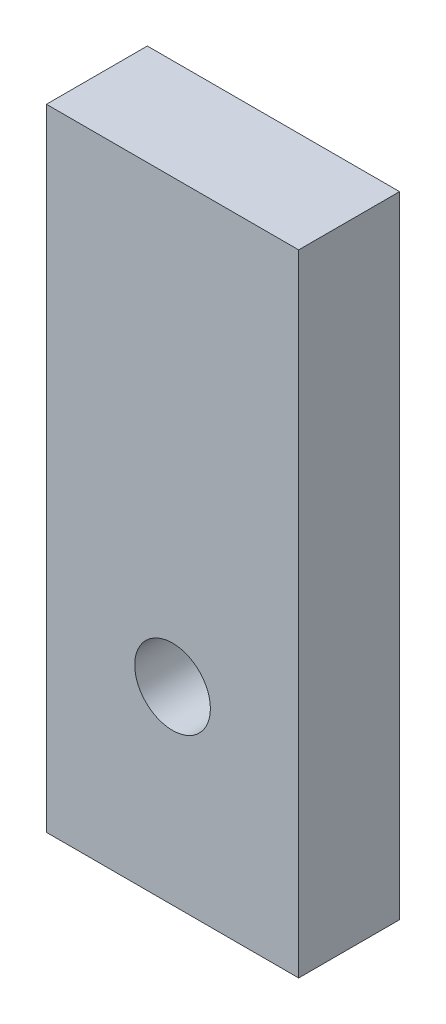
ISO-10303-21;
HEADER;
FILE_DESCRIPTION(('STEP AP214'),'2;1');
FILE_NAME('part.step','',(''),(''),'','','');
FILE_SCHEMA(('AUTOMOTIVE_DESIGN { 1 0 10303 214 1 1 1 1 }'));
ENDSEC;
DATA;
#1=APPLICATION_CONTEXT('core data for automotive mechanical design processes');
#2=APPLICATION_PROTOCOL_DEFINITION('international standard','automotive_design',2000,#1);
#3=PRODUCT_CONTEXT('',#1,'mechanical');
#4=PRODUCT('Part','Part','',(#3));
#5=PRODUCT_RELATED_PRODUCT_CATEGORY('part','',(#4));
#6=PRODUCT_DEFINITION_FORMATION('','',#4);
#7=PRODUCT_DEFINITION_CONTEXT('part definition',#1,'design');
#8=PRODUCT_DEFINITION('design','',#6,#7);
#9=PRODUCT_DEFINITION_SHAPE('','',#8);
#10=(LENGTH_UNIT() NAMED_UNIT(*) SI_UNIT(.MILLI.,.METRE.));
#11=(NAMED_UNIT(*) PLANE_ANGLE_UNIT() SI_UNIT($,.RADIAN.));
#12=(NAMED_UNIT(*) SI_UNIT($,.STERADIAN.) SOLID_ANGLE_UNIT());
#13=UNCERTAINTY_MEASURE_WITH_UNIT(LENGTH_MEASURE(1.E-05),#10,'distance_accuracy_value','');
#14=(GEOMETRIC_REPRESENTATION_CONTEXT(3) GLOBAL_UNCERTAINTY_ASSIGNED_CONTEXT((#13)) GLOBAL_UNIT_ASSIGNED_CONTEXT((#10,
#11,#12)) REPRESENTATION_CONTEXT('',''));
#15=CARTESIAN_POINT('',(0.,0.,0.));
#16=DIRECTION('',(0.,0.,1.));
#17=DIRECTION('',(1.,0.,0.));
#18=AXIS2_PLACEMENT_3D('',#15,#16,#17);
#19=CARTESIAN_POINT('',(0.,0.,4.));
#20=DIRECTION('',(0.,0.,-1.));
#21=DIRECTION('',(-1.,0.,0.));
#22=AXIS2_PLACEMENT_3D('',#19,#20,#21);
#23=PLANE('',#22);
#24=DIRECTION('',(0.,-1.,0.));
#25=VECTOR('',#24,1.);
#26=CARTESIAN_POINT('',(0.,0.,4.));
#27=LINE('',#26,#25);
#28=CARTESIAN_POINT('',(0.,25.,4.));
#29=VERTEX_POINT('',#28);
#30=CARTESIAN_POINT('',(0.,0.,4.));
#31=VERTEX_POINT('',#30);
#32=EDGE_CURVE('E87',#29,#31,#27,.T.);
#33=ORIENTED_EDGE('',*,*,#32,.T.);
#34=DIRECTION('',(1.,0.,0.));
#35=VECTOR('',#34,1.);
#36=CARTESIAN_POINT('',(0.,0.,4.));
#37=LINE('',#36,#35);
#38=CARTESIAN_POINT('',(10.,0.,4.));
#39=VERTEX_POINT('',#38);
#40=EDGE_CURVE('E82',#31,#39,#37,.T.);
#41=ORIENTED_EDGE('',*,*,#40,.T.);
#42=DIRECTION('',(0.,1.,0.));
#43=VECTOR('',#42,1.);
#44=CARTESIAN_POINT('',(10.,0.,4.));
#45=LINE('',#44,#43);
#46=CARTESIAN_POINT('',(10.,25.,4.));
#47=VERTEX_POINT('',#46);
#48=EDGE_CURVE('E85',#39,#47,#45,.T.);
#49=ORIENTED_EDGE('',*,*,#48,.T.);
#50=DIRECTION('',(-1.,0.,0.));
#51=VECTOR('',#50,1.);
#52=CARTESIAN_POINT('',(0.,25.,4.));
#53=LINE('',#52,#51);
#54=EDGE_CURVE('E52',#47,#29,#53,.T.);
#55=ORIENTED_EDGE('',*,*,#54,.T.);
#56=EDGE_LOOP('',(#33,#41,#49,#55));
#57=FACE_BOUND('',#56,.T.);
#58=CARTESIAN_POINT('',(5.,7.5,4.));
#59=DIRECTION('',(0.,0.,1.));
#60=DIRECTION('',(1.,0.,0.));
#61=AXIS2_PLACEMENT_3D('',#58,#59,#60);
#62=CIRCLE('',#61,1.5);
#63=CARTESIAN_POINT('',(6.5,7.5,4.));
#64=VERTEX_POINT('',#63);
#65=EDGE_CURVE('E102',#64,#64,#62,.T.);
#66=ORIENTED_EDGE('',*,*,#65,.F.);
#67=EDGE_LOOP('',(#66));
#68=FACE_BOUND('',#67,.T.);
#69=ADVANCED_FACE('F35',(#57,#68),#23,.F.);
#70=CARTESIAN_POINT('',(0.,0.,0.));
#71=DIRECTION('',(0.,0.,-1.));
#72=DIRECTION('',(-1.,0.,0.));
#73=AXIS2_PLACEMENT_3D('',#70,#71,#72);
#74=PLANE('',#73);
#75=DIRECTION('',(0.,-1.,0.));
#76=VECTOR('',#75,1.);
#77=CARTESIAN_POINT('',(0.,0.,0.));
#78=LINE('',#77,#76);
#79=CARTESIAN_POINT('',(0.,25.,0.));
#80=VERTEX_POINT('',#79);
#81=CARTESIAN_POINT('',(0.,0.,0.));
#82=VERTEX_POINT('',#81);
#83=EDGE_CURVE('E99',#80,#82,#78,.T.);
#84=ORIENTED_EDGE('',*,*,#83,.F.);
#85=DIRECTION('',(-1.,0.,0.));
#86=VECTOR('',#85,1.);
#87=CARTESIAN_POINT('',(0.,25.,0.));
#88=LINE('',#87,#86);
#89=CARTESIAN_POINT('',(10.,25.,0.));
#90=VERTEX_POINT('',#89);
#91=EDGE_CURVE('E75',#90,#80,#88,.T.);
#92=ORIENTED_EDGE('',*,*,#91,.F.);
#93=DIRECTION('',(0.,1.,0.));
#94=VECTOR('',#93,1.);
#95=CARTESIAN_POINT('',(10.,0.,0.));
#96=LINE('',#95,#94);
#97=CARTESIAN_POINT('',(10.,0.,0.));
#98=VERTEX_POINT('',#97);
#99=EDGE_CURVE('E69',#98,#90,#96,.T.);
#100=ORIENTED_EDGE('',*,*,#99,.F.);
#101=DIRECTION('',(1.,0.,0.));
#102=VECTOR('',#101,1.);
#103=CARTESIAN_POINT('',(0.,0.,0.));
#104=LINE('',#103,#102);
#105=EDGE_CURVE('E91',#82,#98,#104,.T.);
#106=ORIENTED_EDGE('',*,*,#105,.F.);
#107=EDGE_LOOP('',(#84,#92,#100,#106));
#108=FACE_BOUND('',#107,.T.);
#109=CARTESIAN_POINT('',(5.,7.5,0.));
#110=DIRECTION('',(0.,0.,1.));
#111=DIRECTION('',(1.,0.,0.));
#112=AXIS2_PLACEMENT_3D('',#109,#110,#111);
#113=CIRCLE('',#112,1.5);
#114=CARTESIAN_POINT('',(6.5,7.5,0.));
#115=VERTEX_POINT('',#114);
#116=EDGE_CURVE('E114',#115,#115,#113,.T.);
#117=ORIENTED_EDGE('',*,*,#116,.T.);
#118=EDGE_LOOP('',(#117));
#119=FACE_BOUND('',#118,.T.);
#120=ADVANCED_FACE('F110',(#108,#119),#74,.T.);
#121=CARTESIAN_POINT('',(0.,0.,4.));
#122=DIRECTION('',(1.,0.,0.));
#123=DIRECTION('',(0.,0.,-1.));
#124=AXIS2_PLACEMENT_3D('',#121,#122,#123);
#125=PLANE('',#124);
#126=ORIENTED_EDGE('',*,*,#83,.T.);
#127=DIRECTION('',(0.,0.,-1.));
#128=VECTOR('',#127,1.);
#129=CARTESIAN_POINT('',(0.,0.,4.));
#130=LINE('',#129,#128);
#131=EDGE_CURVE('E11',#31,#82,#130,.T.);
#132=ORIENTED_EDGE('',*,*,#131,.F.);
#133=ORIENTED_EDGE('',*,*,#32,.F.);
#134=DIRECTION('',(0.,0.,-1.));
#135=VECTOR('',#134,1.);
#136=CARTESIAN_POINT('',(0.,25.,4.));
#137=LINE('',#136,#135);
#138=EDGE_CURVE('E95',#29,#80,#137,.T.);
#139=ORIENTED_EDGE('',*,*,#138,.T.);
#140=EDGE_LOOP('',(#126,#132,#133,#139));
#141=FACE_BOUND('',#140,.T.);
#142=ADVANCED_FACE('F37',(#141),#125,.F.);
#143=CARTESIAN_POINT('',(0.,0.,4.));
#144=DIRECTION('',(0.,1.,0.));
#145=DIRECTION('',(0.,0.,1.));
#146=AXIS2_PLACEMENT_3D('',#143,#144,#145);
#147=PLANE('',#146);
#148=ORIENTED_EDGE('',*,*,#105,.T.);
#149=DIRECTION('',(0.,0.,-1.));
#150=VECTOR('',#149,1.);
#151=CARTESIAN_POINT('',(10.,0.,4.));
#152=LINE('',#151,#150);
#153=EDGE_CURVE('E44',#39,#98,#152,.T.);
#154=ORIENTED_EDGE('',*,*,#153,.F.);
#155=ORIENTED_EDGE('',*,*,#40,.F.);
#156=ORIENTED_EDGE('',*,*,#131,.T.);
#157=EDGE_LOOP('',(#148,#154,#155,#156));
#158=FACE_BOUND('',#157,.T.);
#159=ADVANCED_FACE('F90',(#158),#147,.F.);
#160=CARTESIAN_POINT('',(10.,0.,4.));
#161=DIRECTION('',(-1.,0.,0.));
#162=DIRECTION('',(0.,-1.,0.));
#163=AXIS2_PLACEMENT_3D('',#160,#161,#162);
#164=PLANE('',#163);
#165=ORIENTED_EDGE('',*,*,#99,.T.);
#166=DIRECTION('',(0.,0.,-1.));
#167=VECTOR('',#166,1.);
#168=CARTESIAN_POINT('',(10.,25.,4.));
#169=LINE('',#168,#167);
#170=EDGE_CURVE('E92',#47,#90,#169,.T.);
#171=ORIENTED_EDGE('',*,*,#170,.F.);
#172=ORIENTED_EDGE('',*,*,#48,.F.);
#173=ORIENTED_EDGE('',*,*,#153,.T.);
#174=EDGE_LOOP('',(#165,#171,#172,#173));
#175=FACE_BOUND('',#174,.T.);
#176=ADVANCED_FACE('F93',(#175),#164,.F.);
#177=CARTESIAN_POINT('',(0.,25.,4.));
#178=DIRECTION('',(0.,-1.,0.));
#179=DIRECTION('',(0.,0.,-1.));
#180=AXIS2_PLACEMENT_3D('',#177,#178,#179);
#181=PLANE('',#180);
#182=ORIENTED_EDGE('',*,*,#91,.T.);
#183=ORIENTED_EDGE('',*,*,#138,.F.);
#184=ORIENTED_EDGE('',*,*,#54,.F.);
#185=ORIENTED_EDGE('',*,*,#170,.T.);
#186=EDGE_LOOP('',(#182,#183,#184,#185));
#187=FACE_BOUND('',#186,.T.);
#188=ADVANCED_FACE('F107',(#187),#181,.F.);
#189=CARTESIAN_POINT('',(5.,7.5,4.));
#190=DIRECTION('',(0.,0.,-1.));
#191=DIRECTION('',(-1.,0.,0.));
#192=AXIS2_PLACEMENT_3D('',#189,#190,#191);
#193=CYLINDRICAL_SURFACE('',#192,1.5);
#194=ORIENTED_EDGE('',*,*,#65,.T.);
#195=EDGE_LOOP('',(#194));
#196=FACE_BOUND('',#195,.T.);
#197=ORIENTED_EDGE('',*,*,#116,.F.);
#198=EDGE_LOOP('',(#197));
#199=FACE_BOUND('',#198,.T.);
#200=ADVANCED_FACE('F120',(#196,#199),#193,.F.);
#201=CLOSED_SHELL('',(#69,#120,#142,#159,#176,#188,#200));
#202=MANIFOLD_SOLID_BREP('B2',#201);
#203=ADVANCED_BREP_SHAPE_REPRESENTATION('',(#18,#202),#14);
#204=SHAPE_DEFINITION_REPRESENTATION(#9,#203);
ENDSEC;
END-ISO-10303-21;
